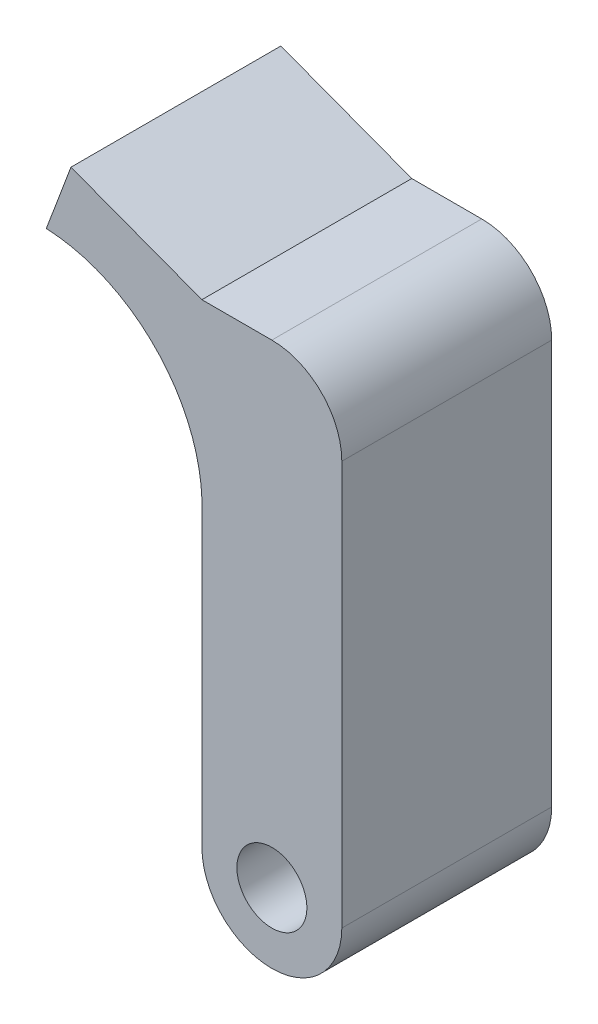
from build123d import *

# Parameters (mm, degrees)
SKETCH1_R           = 3.175
BOSS_EXTRUDE1_DEPTH = 19.05


with BuildPart() as part:
    # Sketch1 → Boss-Extrude1 (new body)
    with BuildSketch(Plane.XY):
        with BuildLine():
            ThreePointArc((-6.35, 0), (0, -6.35), (6.35, 0))
            Line((6.35, 0), (6.35, 36.696854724))
            ThreePointArc((6.35, 36.696854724), (4.490128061, 41.186982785), (0, 43.046854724))
            Line((0, 43.046854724), (-6.35, 43.046854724))
            Line((-6.35, 43.046854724), (-18.235324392, 47.522238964))
            Line((-18.235324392, 47.522238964), (-20.473016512, 41.579576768))
            ThreePointArc((-20.473016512, 41.579576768), (-10.207045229, 36.768291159), (-6.35, 26.107060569))
            Line((-6.35, 26.107060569), (-6.35, 0))
        make_face()
        with Locations(Location((0, 0, 0), (0, 0, 180))):
            Circle(SKETCH1_R, mode=Mode.SUBTRACT)
    extrude(amount=BOSS_EXTRUDE1_DEPTH)


solid = part.part
